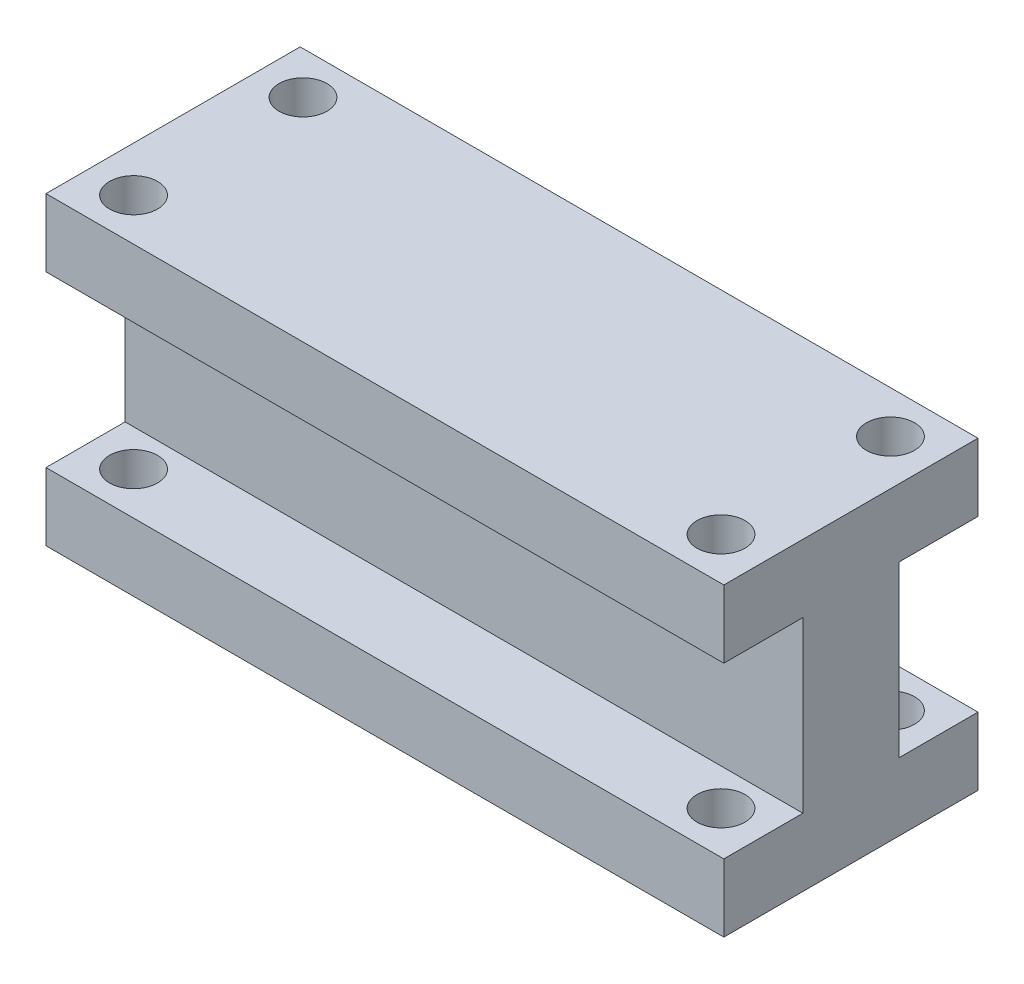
ISO-10303-21;
HEADER;
FILE_DESCRIPTION(('STEP AP214'),'2;1');
FILE_NAME('part.step','',(''),(''),'','','');
FILE_SCHEMA(('AUTOMOTIVE_DESIGN { 1 0 10303 214 1 1 1 1 }'));
ENDSEC;
DATA;
#1=APPLICATION_CONTEXT('core data for automotive mechanical design processes');
#2=APPLICATION_PROTOCOL_DEFINITION('international standard','automotive_design',2000,#1);
#3=PRODUCT_CONTEXT('',#1,'mechanical');
#4=PRODUCT('Part','Part','',(#3));
#5=PRODUCT_RELATED_PRODUCT_CATEGORY('part','',(#4));
#6=PRODUCT_DEFINITION_FORMATION('','',#4);
#7=PRODUCT_DEFINITION_CONTEXT('part definition',#1,'design');
#8=PRODUCT_DEFINITION('design','',#6,#7);
#9=PRODUCT_DEFINITION_SHAPE('','',#8);
#10=(LENGTH_UNIT() NAMED_UNIT(*) SI_UNIT(.MILLI.,.METRE.));
#11=(NAMED_UNIT(*) PLANE_ANGLE_UNIT() SI_UNIT($,.RADIAN.));
#12=(NAMED_UNIT(*) SI_UNIT($,.STERADIAN.) SOLID_ANGLE_UNIT());
#13=UNCERTAINTY_MEASURE_WITH_UNIT(LENGTH_MEASURE(1.E-05),#10,'distance_accuracy_value','');
#14=(GEOMETRIC_REPRESENTATION_CONTEXT(3) GLOBAL_UNCERTAINTY_ASSIGNED_CONTEXT((#13)) GLOBAL_UNIT_ASSIGNED_CONTEXT((#10,
#11,#12)) REPRESENTATION_CONTEXT('',''));
#15=CARTESIAN_POINT('',(0.,0.,0.));
#16=DIRECTION('',(0.,0.,1.));
#17=DIRECTION('',(1.,0.,0.));
#18=AXIS2_PLACEMENT_3D('',#15,#16,#17);
#19=CARTESIAN_POINT('',(52.,0.,15.));
#20=DIRECTION('',(0.,1.,0.));
#21=DIRECTION('',(0.,0.,1.));
#22=AXIS2_PLACEMENT_3D('',#19,#20,#21);
#23=CYLINDRICAL_SURFACE('',#22,4.25);
#24=CARTESIAN_POINT('',(52.,0.,15.));
#25=DIRECTION('',(0.,1.,0.));
#26=DIRECTION('',(0.,0.,1.));
#27=AXIS2_PLACEMENT_3D('',#24,#25,#26);
#28=CIRCLE('',#27,4.25);
#29=CARTESIAN_POINT('',(52.,0.,19.25));
#30=VERTEX_POINT('',#29);
#31=EDGE_CURVE('E153',#30,#30,#28,.F.);
#32=ORIENTED_EDGE('',*,*,#31,.T.);
#33=EDGE_LOOP('',(#32));
#34=FACE_BOUND('',#33,.T.);
#35=CARTESIAN_POINT('',(52.,12.,15.));
#36=DIRECTION('',(0.,1.,0.));
#37=DIRECTION('',(0.,0.,1.));
#38=AXIS2_PLACEMENT_3D('',#35,#36,#37);
#39=CIRCLE('',#38,4.25);
#40=CARTESIAN_POINT('',(52.,12.,19.25));
#41=VERTEX_POINT('',#40);
#42=EDGE_CURVE('E20',#41,#41,#39,.T.);
#43=ORIENTED_EDGE('',*,*,#42,.T.);
#44=EDGE_LOOP('',(#43));
#45=FACE_BOUND('',#44,.T.);
#46=ADVANCED_FACE('F17',(#34,#45),#23,.F.);
#47=CARTESIAN_POINT('',(-52.,0.,15.));
#48=DIRECTION('',(0.,1.,0.));
#49=DIRECTION('',(0.,0.,1.));
#50=AXIS2_PLACEMENT_3D('',#47,#48,#49);
#51=CYLINDRICAL_SURFACE('',#50,4.25);
#52=CARTESIAN_POINT('',(-52.,0.,15.));
#53=DIRECTION('',(0.,1.,0.));
#54=DIRECTION('',(0.,0.,1.));
#55=AXIS2_PLACEMENT_3D('',#52,#53,#54);
#56=CIRCLE('',#55,4.25);
#57=CARTESIAN_POINT('',(-52.,0.,19.25));
#58=VERTEX_POINT('',#57);
#59=EDGE_CURVE('E186',#58,#58,#56,.F.);
#60=ORIENTED_EDGE('',*,*,#59,.T.);
#61=EDGE_LOOP('',(#60));
#62=FACE_BOUND('',#61,.T.);
#63=CARTESIAN_POINT('',(-52.,12.,15.));
#64=DIRECTION('',(0.,1.,0.));
#65=DIRECTION('',(0.,0.,1.));
#66=AXIS2_PLACEMENT_3D('',#63,#64,#65);
#67=CIRCLE('',#66,4.25);
#68=CARTESIAN_POINT('',(-52.,12.,19.25));
#69=VERTEX_POINT('',#68);
#70=EDGE_CURVE('E156',#69,#69,#67,.T.);
#71=ORIENTED_EDGE('',*,*,#70,.T.);
#72=EDGE_LOOP('',(#71));
#73=FACE_BOUND('',#72,.T.);
#74=ADVANCED_FACE('F289',(#62,#73),#51,.F.);
#75=CARTESIAN_POINT('',(52.,0.,-15.));
#76=DIRECTION('',(0.,1.,0.));
#77=DIRECTION('',(0.,0.,1.));
#78=AXIS2_PLACEMENT_3D('',#75,#76,#77);
#79=CYLINDRICAL_SURFACE('',#78,4.25);
#80=CARTESIAN_POINT('',(52.,12.,-15.));
#81=DIRECTION('',(0.,1.,0.));
#82=DIRECTION('',(0.,0.,1.));
#83=AXIS2_PLACEMENT_3D('',#80,#81,#82);
#84=CIRCLE('',#83,4.25);
#85=CARTESIAN_POINT('',(52.,12.,-10.75));
#86=VERTEX_POINT('',#85);
#87=EDGE_CURVE('E147',#86,#86,#84,.T.);
#88=ORIENTED_EDGE('',*,*,#87,.T.);
#89=EDGE_LOOP('',(#88));
#90=FACE_BOUND('',#89,.T.);
#91=CARTESIAN_POINT('',(52.,0.,-15.));
#92=DIRECTION('',(0.,1.,0.));
#93=DIRECTION('',(0.,0.,1.));
#94=AXIS2_PLACEMENT_3D('',#91,#92,#93);
#95=CIRCLE('',#94,4.25);
#96=CARTESIAN_POINT('',(52.,0.,-10.75));
#97=VERTEX_POINT('',#96);
#98=EDGE_CURVE('E189',#97,#97,#95,.F.);
#99=ORIENTED_EDGE('',*,*,#98,.T.);
#100=EDGE_LOOP('',(#99));
#101=FACE_BOUND('',#100,.T.);
#102=ADVANCED_FACE('F293',(#90,#101),#79,.F.);
#103=CARTESIAN_POINT('',(-52.,0.,-15.));
#104=DIRECTION('',(0.,1.,0.));
#105=DIRECTION('',(0.,0.,1.));
#106=AXIS2_PLACEMENT_3D('',#103,#104,#105);
#107=CYLINDRICAL_SURFACE('',#106,4.25);
#108=CARTESIAN_POINT('',(-52.,12.,-15.));
#109=DIRECTION('',(0.,1.,0.));
#110=DIRECTION('',(0.,0.,1.));
#111=AXIS2_PLACEMENT_3D('',#108,#109,#110);
#112=CIRCLE('',#111,4.25);
#113=CARTESIAN_POINT('',(-52.,12.,-10.75));
#114=VERTEX_POINT('',#113);
#115=EDGE_CURVE('E119',#114,#114,#112,.T.);
#116=ORIENTED_EDGE('',*,*,#115,.T.);
#117=EDGE_LOOP('',(#116));
#118=FACE_BOUND('',#117,.T.);
#119=CARTESIAN_POINT('',(-52.,0.,-15.));
#120=DIRECTION('',(0.,1.,0.));
#121=DIRECTION('',(0.,0.,1.));
#122=AXIS2_PLACEMENT_3D('',#119,#120,#121);
#123=CIRCLE('',#122,4.25);
#124=CARTESIAN_POINT('',(-52.,0.,-10.75));
#125=VERTEX_POINT('',#124);
#126=EDGE_CURVE('E150',#125,#125,#123,.F.);
#127=ORIENTED_EDGE('',*,*,#126,.T.);
#128=EDGE_LOOP('',(#127));
#129=FACE_BOUND('',#128,.T.);
#130=ADVANCED_FACE('F214',(#118,#129),#107,.F.);
#131=CARTESIAN_POINT('',(-60.,12.,8.50000000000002));
#132=DIRECTION('',(0.,0.,-1.));
#133=DIRECTION('',(-1.,0.,0.));
#134=AXIS2_PLACEMENT_3D('',#131,#132,#133);
#135=PLANE('',#134);
#136=DIRECTION('',(1.,0.,0.));
#137=VECTOR('',#136,1.);
#138=CARTESIAN_POINT('',(-60.,42.,8.5));
#139=LINE('',#138,#137);
#140=CARTESIAN_POINT('',(60.,42.,8.5));
#141=VERTEX_POINT('',#140);
#142=CARTESIAN_POINT('',(-60.,42.,8.50000000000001));
#143=VERTEX_POINT('',#142);
#144=EDGE_CURVE('E139',#141,#143,#139,.F.);
#145=ORIENTED_EDGE('',*,*,#144,.T.);
#146=DIRECTION('',(0.,1.,0.));
#147=VECTOR('',#146,1.);
#148=CARTESIAN_POINT('',(-60.,54.,8.50000000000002));
#149=LINE('',#148,#147);
#150=CARTESIAN_POINT('',(-60.,12.,8.50000000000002));
#151=VERTEX_POINT('',#150);
#152=EDGE_CURVE('E451',#143,#151,#149,.F.);
#153=ORIENTED_EDGE('',*,*,#152,.T.);
#154=DIRECTION('',(1.,0.,0.));
#155=VECTOR('',#154,1.);
#156=CARTESIAN_POINT('',(-60.,12.,8.50000000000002));
#157=LINE('',#156,#155);
#158=CARTESIAN_POINT('',(60.,12.,8.50000000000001));
#159=VERTEX_POINT('',#158);
#160=EDGE_CURVE('E154',#151,#159,#157,.T.);
#161=ORIENTED_EDGE('',*,*,#160,.T.);
#162=DIRECTION('',(0.,1.,0.));
#163=VECTOR('',#162,1.);
#164=CARTESIAN_POINT('',(60.0000000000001,54.,8.5));
#165=LINE('',#164,#163);
#166=EDGE_CURVE('E467',#159,#141,#165,.T.);
#167=ORIENTED_EDGE('',*,*,#166,.T.);
#168=EDGE_LOOP('',(#145,#153,#161,#167));
#169=FACE_BOUND('',#168,.T.);
#170=ADVANCED_FACE('F203',(#169),#135,.F.);
#171=CARTESIAN_POINT('',(-60.,12.,36.5));
#172=DIRECTION('',(0.,-1.,0.));
#173=DIRECTION('',(0.,0.,-1.));
#174=AXIS2_PLACEMENT_3D('',#171,#172,#173);
#175=PLANE('',#174);
#176=ORIENTED_EDGE('',*,*,#160,.F.);
#177=DIRECTION('',(0.,0.,-1.));
#178=VECTOR('',#177,1.);
#179=CARTESIAN_POINT('',(-60.,12.,-22.5));
#180=LINE('',#179,#178);
#181=CARTESIAN_POINT('',(-60.,12.,22.5));
#182=VERTEX_POINT('',#181);
#183=EDGE_CURVE('E446',#151,#182,#180,.F.);
#184=ORIENTED_EDGE('',*,*,#183,.T.);
#185=DIRECTION('',(-1.,0.,0.));
#186=VECTOR('',#185,1.);
#187=CARTESIAN_POINT('',(-60.,12.,22.5));
#188=LINE('',#187,#186);
#189=CARTESIAN_POINT('',(60.0000000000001,12.,22.5));
#190=VERTEX_POINT('',#189);
#191=EDGE_CURVE('E151',#182,#190,#188,.F.);
#192=ORIENTED_EDGE('',*,*,#191,.T.);
#193=DIRECTION('',(0.,0.,1.));
#194=VECTOR('',#193,1.);
#195=CARTESIAN_POINT('',(60.,12.,-22.5));
#196=LINE('',#195,#194);
#197=EDGE_CURVE('E469',#190,#159,#196,.F.);
#198=ORIENTED_EDGE('',*,*,#197,.T.);
#199=EDGE_LOOP('',(#176,#184,#192,#198));
#200=FACE_BOUND('',#199,.T.);
#201=ORIENTED_EDGE('',*,*,#70,.F.);
#202=EDGE_LOOP('',(#201));
#203=FACE_BOUND('',#202,.T.);
#204=ORIENTED_EDGE('',*,*,#42,.F.);
#205=EDGE_LOOP('',(#204));
#206=FACE_BOUND('',#205,.T.);
#207=ADVANCED_FACE('F200',(#200,#203,#206),#175,.F.);
#208=CARTESIAN_POINT('',(-60.,54.,22.5));
#209=DIRECTION('',(0.,0.,-1.));
#210=DIRECTION('',(-1.,0.,0.));
#211=AXIS2_PLACEMENT_3D('',#208,#209,#210);
#212=PLANE('',#211);
#213=ORIENTED_EDGE('',*,*,#191,.F.);
#214=DIRECTION('',(0.,1.,0.));
#215=VECTOR('',#214,1.);
#216=CARTESIAN_POINT('',(-60.,54.,22.5));
#217=LINE('',#216,#215);
#218=CARTESIAN_POINT('',(-60.,0.,22.5));
#219=VERTEX_POINT('',#218);
#220=EDGE_CURVE('E442',#182,#219,#217,.F.);
#221=ORIENTED_EDGE('',*,*,#220,.T.);
#222=DIRECTION('',(1.,0.,0.));
#223=VECTOR('',#222,1.);
#224=CARTESIAN_POINT('',(0.,0.,22.5));
#225=LINE('',#224,#223);
#226=CARTESIAN_POINT('',(60.0000000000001,0.,22.5));
#227=VERTEX_POINT('',#226);
#228=EDGE_CURVE('E148',#219,#227,#225,.T.);
#229=ORIENTED_EDGE('',*,*,#228,.T.);
#230=DIRECTION('',(0.,1.,0.));
#231=VECTOR('',#230,1.);
#232=CARTESIAN_POINT('',(60.0000000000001,54.,22.5));
#233=LINE('',#232,#231);
#234=EDGE_CURVE('E135',#227,#190,#233,.T.);
#235=ORIENTED_EDGE('',*,*,#234,.T.);
#236=EDGE_LOOP('',(#213,#221,#229,#235));
#237=FACE_BOUND('',#236,.T.);
#238=ADVANCED_FACE('F202',(#237),#212,.F.);
#239=CARTESIAN_POINT('',(0.,0.,0.));
#240=DIRECTION('',(0.,1.,0.));
#241=DIRECTION('',(0.,0.,1.));
#242=AXIS2_PLACEMENT_3D('',#239,#240,#241);
#243=PLANE('',#242);
#244=ORIENTED_EDGE('',*,*,#228,.F.);
#245=DIRECTION('',(0.,0.,-1.));
#246=VECTOR('',#245,1.);
#247=CARTESIAN_POINT('',(-60.,0.,-22.5));
#248=LINE('',#247,#246);
#249=CARTESIAN_POINT('',(-60.,0.,-22.5));
#250=VERTEX_POINT('',#249);
#251=EDGE_CURVE('E437',#219,#250,#248,.T.);
#252=ORIENTED_EDGE('',*,*,#251,.T.);
#253=DIRECTION('',(1.,0.,0.));
#254=VECTOR('',#253,1.);
#255=CARTESIAN_POINT('',(-60.,0.,-22.5));
#256=LINE('',#255,#254);
#257=CARTESIAN_POINT('',(60.,0.,-22.5));
#258=VERTEX_POINT('',#257);
#259=EDGE_CURVE('E145',#250,#258,#256,.T.);
#260=ORIENTED_EDGE('',*,*,#259,.T.);
#261=DIRECTION('',(0.,0.,1.));
#262=VECTOR('',#261,1.);
#263=CARTESIAN_POINT('',(60.,0.,-22.5));
#264=LINE('',#263,#262);
#265=EDGE_CURVE('E133',#258,#227,#264,.T.);
#266=ORIENTED_EDGE('',*,*,#265,.T.);
#267=EDGE_LOOP('',(#244,#252,#260,#266));
#268=FACE_BOUND('',#267,.T.);
#269=ORIENTED_EDGE('',*,*,#126,.F.);
#270=EDGE_LOOP('',(#269));
#271=FACE_BOUND('',#270,.T.);
#272=ORIENTED_EDGE('',*,*,#59,.F.);
#273=EDGE_LOOP('',(#272));
#274=FACE_BOUND('',#273,.T.);
#275=ORIENTED_EDGE('',*,*,#98,.F.);
#276=EDGE_LOOP('',(#275));
#277=FACE_BOUND('',#276,.T.);
#278=ORIENTED_EDGE('',*,*,#31,.F.);
#279=EDGE_LOOP('',(#278));
#280=FACE_BOUND('',#279,.T.);
#281=ADVANCED_FACE('F211',(#268,#271,#274,#277,#280),#243,.F.);
#282=CARTESIAN_POINT('',(-60.,54.,-22.5));
#283=DIRECTION('',(0.,0.,1.));
#284=DIRECTION('',(1.,0.,0.));
#285=AXIS2_PLACEMENT_3D('',#282,#283,#284);
#286=PLANE('',#285);
#287=DIRECTION('',(1.,0.,0.));
#288=VECTOR('',#287,1.);
#289=CARTESIAN_POINT('',(-60.,12.,-22.5));
#290=LINE('',#289,#288);
#291=CARTESIAN_POINT('',(-60.,12.,-22.5));
#292=VERTEX_POINT('',#291);
#293=CARTESIAN_POINT('',(60.,12.,-22.5));
#294=VERTEX_POINT('',#293);
#295=EDGE_CURVE('E110',#292,#294,#290,.T.);
#296=ORIENTED_EDGE('',*,*,#295,.T.);
#297=DIRECTION('',(0.,1.,0.));
#298=VECTOR('',#297,1.);
#299=CARTESIAN_POINT('',(60.,54.,-22.5));
#300=LINE('',#299,#298);
#301=EDGE_CURVE('E114',#294,#258,#300,.F.);
#302=ORIENTED_EDGE('',*,*,#301,.T.);
#303=ORIENTED_EDGE('',*,*,#259,.F.);
#304=DIRECTION('',(0.,1.,0.));
#305=VECTOR('',#304,1.);
#306=CARTESIAN_POINT('',(-60.,54.,-22.5));
#307=LINE('',#306,#305);
#308=EDGE_CURVE('E117',#250,#292,#307,.T.);
#309=ORIENTED_EDGE('',*,*,#308,.T.);
#310=EDGE_LOOP('',(#296,#302,#303,#309));
#311=FACE_BOUND('',#310,.T.);
#312=ADVANCED_FACE('F111',(#311),#286,.F.);
#313=CARTESIAN_POINT('',(-60.,12.,-36.5));
#314=DIRECTION('',(0.,-1.,0.));
#315=DIRECTION('',(0.,0.,-1.));
#316=AXIS2_PLACEMENT_3D('',#313,#314,#315);
#317=PLANE('',#316);
#318=DIRECTION('',(1.,0.,0.));
#319=VECTOR('',#318,1.);
#320=CARTESIAN_POINT('',(-60.,12.,-8.49999999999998));
#321=LINE('',#320,#319);
#322=CARTESIAN_POINT('',(-60.,12.,-8.49999999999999));
#323=VERTEX_POINT('',#322);
#324=CARTESIAN_POINT('',(60.,12.,-8.5));
#325=VERTEX_POINT('',#324);
#326=EDGE_CURVE('E104',#323,#325,#321,.T.);
#327=ORIENTED_EDGE('',*,*,#326,.T.);
#328=DIRECTION('',(0.,0.,1.));
#329=VECTOR('',#328,1.);
#330=CARTESIAN_POINT('',(60.,12.,-22.5));
#331=LINE('',#330,#329);
#332=EDGE_CURVE('E122',#325,#294,#331,.F.);
#333=ORIENTED_EDGE('',*,*,#332,.T.);
#334=ORIENTED_EDGE('',*,*,#295,.F.);
#335=DIRECTION('',(0.,0.,-1.));
#336=VECTOR('',#335,1.);
#337=CARTESIAN_POINT('',(-60.,12.,-22.5));
#338=LINE('',#337,#336);
#339=EDGE_CURVE('E444',#292,#323,#338,.F.);
#340=ORIENTED_EDGE('',*,*,#339,.T.);
#341=EDGE_LOOP('',(#327,#333,#334,#340));
#342=FACE_BOUND('',#341,.T.);
#343=ORIENTED_EDGE('',*,*,#115,.F.);
#344=EDGE_LOOP('',(#343));
#345=FACE_BOUND('',#344,.T.);
#346=ORIENTED_EDGE('',*,*,#87,.F.);
#347=EDGE_LOOP('',(#346));
#348=FACE_BOUND('',#347,.T.);
#349=ADVANCED_FACE('F123',(#342,#345,#348),#317,.F.);
#350=CARTESIAN_POINT('',(-60.,12.,-8.49999999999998));
#351=DIRECTION('',(0.,0.,1.));
#352=DIRECTION('',(1.,0.,0.));
#353=AXIS2_PLACEMENT_3D('',#350,#351,#352);
#354=PLANE('',#353);
#355=ORIENTED_EDGE('',*,*,#326,.F.);
#356=DIRECTION('',(0.,1.,0.));
#357=VECTOR('',#356,1.);
#358=CARTESIAN_POINT('',(-60.,54.,-8.49999999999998));
#359=LINE('',#358,#357);
#360=CARTESIAN_POINT('',(-60.,42.,-8.49999999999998));
#361=VERTEX_POINT('',#360);
#362=EDGE_CURVE('E492',#323,#361,#359,.T.);
#363=ORIENTED_EDGE('',*,*,#362,.T.);
#364=DIRECTION('',(1.,0.,0.));
#365=VECTOR('',#364,1.);
#366=CARTESIAN_POINT('',(-60.,42.,-8.49999999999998));
#367=LINE('',#366,#365);
#368=CARTESIAN_POINT('',(60.,42.,-8.49999999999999));
#369=VERTEX_POINT('',#368);
#370=EDGE_CURVE('E142',#361,#369,#367,.T.);
#371=ORIENTED_EDGE('',*,*,#370,.T.);
#372=DIRECTION('',(0.,1.,0.));
#373=VECTOR('',#372,1.);
#374=CARTESIAN_POINT('',(60.,54.,-8.5));
#375=LINE('',#374,#373);
#376=EDGE_CURVE('E460',#369,#325,#375,.F.);
#377=ORIENTED_EDGE('',*,*,#376,.T.);
#378=EDGE_LOOP('',(#355,#363,#371,#377));
#379=FACE_BOUND('',#378,.T.);
#380=ADVANCED_FACE('F264',(#379),#354,.F.);
#381=CARTESIAN_POINT('',(-60.,42.,-36.5));
#382=DIRECTION('',(0.,1.,0.));
#383=DIRECTION('',(0.,0.,1.));
#384=AXIS2_PLACEMENT_3D('',#381,#382,#383);
#385=PLANE('',#384);
#386=ORIENTED_EDGE('',*,*,#370,.F.);
#387=DIRECTION('',(0.,0.,-1.));
#388=VECTOR('',#387,1.);
#389=CARTESIAN_POINT('',(-60.,42.,-22.5));
#390=LINE('',#389,#388);
#391=CARTESIAN_POINT('',(-60.,42.,-22.5));
#392=VERTEX_POINT('',#391);
#393=EDGE_CURVE('E490',#361,#392,#390,.T.);
#394=ORIENTED_EDGE('',*,*,#393,.T.);
#395=DIRECTION('',(1.,0.,0.));
#396=VECTOR('',#395,1.);
#397=CARTESIAN_POINT('',(-60.,42.,-22.5));
#398=LINE('',#397,#396);
#399=CARTESIAN_POINT('',(60.,42.,-22.5));
#400=VERTEX_POINT('',#399);
#401=EDGE_CURVE('E458',#392,#400,#398,.T.);
#402=ORIENTED_EDGE('',*,*,#401,.T.);
#403=DIRECTION('',(0.,0.,1.));
#404=VECTOR('',#403,1.);
#405=CARTESIAN_POINT('',(60.,42.,-22.5));
#406=LINE('',#405,#404);
#407=EDGE_CURVE('E462',#400,#369,#406,.T.);
#408=ORIENTED_EDGE('',*,*,#407,.T.);
#409=EDGE_LOOP('',(#386,#394,#402,#408));
#410=FACE_BOUND('',#409,.T.);
#411=CARTESIAN_POINT('',(-52.,42.,-15.));
#412=DIRECTION('',(0.,1.,0.));
#413=DIRECTION('',(0.,0.,1.));
#414=AXIS2_PLACEMENT_3D('',#411,#412,#413);
#415=CIRCLE('',#414,4.25);
#416=CARTESIAN_POINT('',(-52.,42.,-10.75));
#417=VERTEX_POINT('',#416);
#418=EDGE_CURVE('E127',#417,#417,#415,.T.);
#419=ORIENTED_EDGE('',*,*,#418,.T.);
#420=EDGE_LOOP('',(#419));
#421=FACE_BOUND('',#420,.T.);
#422=CARTESIAN_POINT('',(52.,42.,-15.));
#423=DIRECTION('',(0.,1.,0.));
#424=DIRECTION('',(0.,0.,1.));
#425=AXIS2_PLACEMENT_3D('',#422,#423,#424);
#426=CIRCLE('',#425,4.25);
#427=CARTESIAN_POINT('',(52.,42.,-10.75));
#428=VERTEX_POINT('',#427);
#429=EDGE_CURVE('E175',#428,#428,#426,.T.);
#430=ORIENTED_EDGE('',*,*,#429,.T.);
#431=EDGE_LOOP('',(#430));
#432=FACE_BOUND('',#431,.T.);
#433=ADVANCED_FACE('F260',(#410,#421,#432),#385,.F.);
#434=CARTESIAN_POINT('',(-60.,42.,36.5));
#435=DIRECTION('',(0.,1.,0.));
#436=DIRECTION('',(0.,0.,1.));
#437=AXIS2_PLACEMENT_3D('',#434,#435,#436);
#438=PLANE('',#437);
#439=ORIENTED_EDGE('',*,*,#144,.F.);
#440=DIRECTION('',(0.,0.,1.));
#441=VECTOR('',#440,1.);
#442=CARTESIAN_POINT('',(60.,42.,-22.5));
#443=LINE('',#442,#441);
#444=CARTESIAN_POINT('',(60.0000000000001,42.,22.5));
#445=VERTEX_POINT('',#444);
#446=EDGE_CURVE('E465',#141,#445,#443,.T.);
#447=ORIENTED_EDGE('',*,*,#446,.T.);
#448=DIRECTION('',(-1.,0.,0.));
#449=VECTOR('',#448,1.);
#450=CARTESIAN_POINT('',(-60.,42.,22.5));
#451=LINE('',#450,#449);
#452=CARTESIAN_POINT('',(-60.,42.,22.5));
#453=VERTEX_POINT('',#452);
#454=EDGE_CURVE('E479',#445,#453,#451,.T.);
#455=ORIENTED_EDGE('',*,*,#454,.T.);
#456=DIRECTION('',(0.,0.,-1.));
#457=VECTOR('',#456,1.);
#458=CARTESIAN_POINT('',(-60.,42.,-22.5));
#459=LINE('',#458,#457);
#460=EDGE_CURVE('E453',#453,#143,#459,.T.);
#461=ORIENTED_EDGE('',*,*,#460,.T.);
#462=EDGE_LOOP('',(#439,#447,#455,#461));
#463=FACE_BOUND('',#462,.T.);
#464=CARTESIAN_POINT('',(-52.,42.,15.));
#465=DIRECTION('',(0.,1.,0.));
#466=DIRECTION('',(0.,0.,1.));
#467=AXIS2_PLACEMENT_3D('',#464,#465,#466);
#468=CIRCLE('',#467,4.25);
#469=CARTESIAN_POINT('',(-52.,42.,19.25));
#470=VERTEX_POINT('',#469);
#471=EDGE_CURVE('E172',#470,#470,#468,.T.);
#472=ORIENTED_EDGE('',*,*,#471,.T.);
#473=EDGE_LOOP('',(#472));
#474=FACE_BOUND('',#473,.T.);
#475=CARTESIAN_POINT('',(52.,42.,15.));
#476=DIRECTION('',(0.,1.,0.));
#477=DIRECTION('',(0.,0.,1.));
#478=AXIS2_PLACEMENT_3D('',#475,#476,#477);
#479=CIRCLE('',#478,4.25);
#480=CARTESIAN_POINT('',(52.,42.,19.25));
#481=VERTEX_POINT('',#480);
#482=EDGE_CURVE('E141',#481,#481,#479,.T.);
#483=ORIENTED_EDGE('',*,*,#482,.T.);
#484=EDGE_LOOP('',(#483));
#485=FACE_BOUND('',#484,.T.);
#486=ADVANCED_FACE('F256',(#463,#474,#485),#438,.F.);
#487=CARTESIAN_POINT('',(52.,0.,15.));
#488=DIRECTION('',(0.,1.,0.));
#489=DIRECTION('',(0.,0.,1.));
#490=AXIS2_PLACEMENT_3D('',#487,#488,#489);
#491=CYLINDRICAL_SURFACE('',#490,4.25);
#492=CARTESIAN_POINT('',(52.,54.,15.));
#493=DIRECTION('',(0.,1.,0.));
#494=DIRECTION('',(0.,0.,1.));
#495=AXIS2_PLACEMENT_3D('',#492,#493,#494);
#496=CIRCLE('',#495,4.25);
#497=CARTESIAN_POINT('',(52.,54.,19.25));
#498=VERTEX_POINT('',#497);
#499=EDGE_CURVE('E167',#498,#498,#496,.F.);
#500=ORIENTED_EDGE('',*,*,#499,.F.);
#501=EDGE_LOOP('',(#500));
#502=FACE_BOUND('',#501,.T.);
#503=ORIENTED_EDGE('',*,*,#482,.F.);
#504=EDGE_LOOP('',(#503));
#505=FACE_BOUND('',#504,.T.);
#506=ADVANCED_FACE('F252',(#502,#505),#491,.F.);
#507=CARTESIAN_POINT('',(52.,0.,-15.));
#508=DIRECTION('',(0.,1.,0.));
#509=DIRECTION('',(0.,0.,1.));
#510=AXIS2_PLACEMENT_3D('',#507,#508,#509);
#511=CYLINDRICAL_SURFACE('',#510,4.25);
#512=CARTESIAN_POINT('',(52.,54.,-15.));
#513=DIRECTION('',(0.,1.,0.));
#514=DIRECTION('',(0.,0.,1.));
#515=AXIS2_PLACEMENT_3D('',#512,#513,#514);
#516=CIRCLE('',#515,4.25);
#517=CARTESIAN_POINT('',(52.,54.,-10.75));
#518=VERTEX_POINT('',#517);
#519=EDGE_CURVE('E164',#518,#518,#516,.F.);
#520=ORIENTED_EDGE('',*,*,#519,.F.);
#521=EDGE_LOOP('',(#520));
#522=FACE_BOUND('',#521,.T.);
#523=ORIENTED_EDGE('',*,*,#429,.F.);
#524=EDGE_LOOP('',(#523));
#525=FACE_BOUND('',#524,.T.);
#526=ADVANCED_FACE('F248',(#522,#525),#511,.F.);
#527=CARTESIAN_POINT('',(-52.,0.,15.));
#528=DIRECTION('',(0.,1.,0.));
#529=DIRECTION('',(0.,0.,1.));
#530=AXIS2_PLACEMENT_3D('',#527,#528,#529);
#531=CYLINDRICAL_SURFACE('',#530,4.25);
#532=CARTESIAN_POINT('',(-52.,54.,15.));
#533=DIRECTION('',(0.,1.,0.));
#534=DIRECTION('',(0.,0.,1.));
#535=AXIS2_PLACEMENT_3D('',#532,#533,#534);
#536=CIRCLE('',#535,4.25);
#537=CARTESIAN_POINT('',(-52.,54.,19.25));
#538=VERTEX_POINT('',#537);
#539=EDGE_CURVE('E161',#538,#538,#536,.F.);
#540=ORIENTED_EDGE('',*,*,#539,.F.);
#541=EDGE_LOOP('',(#540));
#542=FACE_BOUND('',#541,.T.);
#543=ORIENTED_EDGE('',*,*,#471,.F.);
#544=EDGE_LOOP('',(#543));
#545=FACE_BOUND('',#544,.T.);
#546=ADVANCED_FACE('F244',(#542,#545),#531,.F.);
#547=CARTESIAN_POINT('',(-52.,0.,-15.));
#548=DIRECTION('',(0.,1.,0.));
#549=DIRECTION('',(0.,0.,1.));
#550=AXIS2_PLACEMENT_3D('',#547,#548,#549);
#551=CYLINDRICAL_SURFACE('',#550,4.25);
#552=CARTESIAN_POINT('',(-52.,54.,-15.));
#553=DIRECTION('',(0.,1.,0.));
#554=DIRECTION('',(0.,0.,1.));
#555=AXIS2_PLACEMENT_3D('',#552,#553,#554);
#556=CIRCLE('',#555,4.25);
#557=CARTESIAN_POINT('',(-52.,54.,-10.75));
#558=VERTEX_POINT('',#557);
#559=EDGE_CURVE('E157',#558,#558,#556,.F.);
#560=ORIENTED_EDGE('',*,*,#559,.F.);
#561=EDGE_LOOP('',(#560));
#562=FACE_BOUND('',#561,.T.);
#563=ORIENTED_EDGE('',*,*,#418,.F.);
#564=EDGE_LOOP('',(#563));
#565=FACE_BOUND('',#564,.T.);
#566=ADVANCED_FACE('F241',(#562,#565),#551,.F.);
#567=CARTESIAN_POINT('',(60.,54.,-22.5));
#568=DIRECTION('',(-1.,0.,0.));
#569=DIRECTION('',(0.,0.,1.));
#570=AXIS2_PLACEMENT_3D('',#567,#568,#569);
#571=PLANE('',#570);
#572=ORIENTED_EDGE('',*,*,#407,.F.);
#573=DIRECTION('',(0.,1.,0.));
#574=VECTOR('',#573,1.);
#575=CARTESIAN_POINT('',(60.,54.,-22.5));
#576=LINE('',#575,#574);
#577=CARTESIAN_POINT('',(60.,54.,-22.5));
#578=VERTEX_POINT('',#577);
#579=EDGE_CURVE('E456',#400,#578,#576,.T.);
#580=ORIENTED_EDGE('',*,*,#579,.T.);
#581=DIRECTION('',(0.,0.,1.));
#582=VECTOR('',#581,1.);
#583=CARTESIAN_POINT('',(60.0000000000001,54.,0.));
#584=LINE('',#583,#582);
#585=CARTESIAN_POINT('',(60.0000000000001,54.,22.5));
#586=VERTEX_POINT('',#585);
#587=EDGE_CURVE('E160',#586,#578,#584,.F.);
#588=ORIENTED_EDGE('',*,*,#587,.F.);
#589=DIRECTION('',(0.,1.,0.));
#590=VECTOR('',#589,1.);
#591=CARTESIAN_POINT('',(60.,54.,22.5));
#592=LINE('',#591,#590);
#593=EDGE_CURVE('E482',#586,#445,#592,.F.);
#594=ORIENTED_EDGE('',*,*,#593,.T.);
#595=ORIENTED_EDGE('',*,*,#446,.F.);
#596=ORIENTED_EDGE('',*,*,#166,.F.);
#597=ORIENTED_EDGE('',*,*,#197,.F.);
#598=ORIENTED_EDGE('',*,*,#234,.F.);
#599=ORIENTED_EDGE('',*,*,#265,.F.);
#600=ORIENTED_EDGE('',*,*,#301,.F.);
#601=ORIENTED_EDGE('',*,*,#332,.F.);
#602=ORIENTED_EDGE('',*,*,#376,.F.);
#603=EDGE_LOOP('',(#572,#580,#588,#594,#595,#596,#597,#598,#599,#600,#601,#602));
#604=FACE_BOUND('',#603,.T.);
#605=ADVANCED_FACE('F130',(#604),#571,.F.);
#606=CARTESIAN_POINT('',(-60.,54.,-22.5));
#607=DIRECTION('',(0.,0.,1.));
#608=DIRECTION('',(1.,0.,0.));
#609=AXIS2_PLACEMENT_3D('',#606,#607,#608);
#610=PLANE('',#609);
#611=ORIENTED_EDGE('',*,*,#401,.F.);
#612=DIRECTION('',(0.,1.,0.));
#613=VECTOR('',#612,1.);
#614=CARTESIAN_POINT('',(-60.,54.,-22.5));
#615=LINE('',#614,#613);
#616=CARTESIAN_POINT('',(-60.,54.,-22.5));
#617=VERTEX_POINT('',#616);
#618=EDGE_CURVE('E485',#392,#617,#615,.T.);
#619=ORIENTED_EDGE('',*,*,#618,.T.);
#620=DIRECTION('',(1.,0.,0.));
#621=VECTOR('',#620,1.);
#622=CARTESIAN_POINT('',(0.,54.,-22.5));
#623=LINE('',#622,#621);
#624=EDGE_CURVE('E501',#578,#617,#623,.F.);
#625=ORIENTED_EDGE('',*,*,#624,.F.);
#626=ORIENTED_EDGE('',*,*,#579,.F.);
#627=EDGE_LOOP('',(#611,#619,#625,#626));
#628=FACE_BOUND('',#627,.T.);
#629=ADVANCED_FACE('F235',(#628),#610,.F.);
#630=CARTESIAN_POINT('',(-60.,54.,-22.5));
#631=DIRECTION('',(1.,0.,0.));
#632=DIRECTION('',(0.,0.,-1.));
#633=AXIS2_PLACEMENT_3D('',#630,#631,#632);
#634=PLANE('',#633);
#635=ORIENTED_EDGE('',*,*,#393,.F.);
#636=ORIENTED_EDGE('',*,*,#362,.F.);
#637=ORIENTED_EDGE('',*,*,#339,.F.);
#638=ORIENTED_EDGE('',*,*,#308,.F.);
#639=ORIENTED_EDGE('',*,*,#251,.F.);
#640=ORIENTED_EDGE('',*,*,#220,.F.);
#641=ORIENTED_EDGE('',*,*,#183,.F.);
#642=ORIENTED_EDGE('',*,*,#152,.F.);
#643=ORIENTED_EDGE('',*,*,#460,.F.);
#644=DIRECTION('',(0.,1.,0.));
#645=VECTOR('',#644,1.);
#646=CARTESIAN_POINT('',(-60.,54.,22.5));
#647=LINE('',#646,#645);
#648=CARTESIAN_POINT('',(-60.,54.,22.5));
#649=VERTEX_POINT('',#648);
#650=EDGE_CURVE('E35',#453,#649,#647,.T.);
#651=ORIENTED_EDGE('',*,*,#650,.T.);
#652=DIRECTION('',(0.,0.,1.));
#653=VECTOR('',#652,1.);
#654=CARTESIAN_POINT('',(-60.,54.,0.));
#655=LINE('',#654,#653);
#656=EDGE_CURVE('E26',#617,#649,#655,.T.);
#657=ORIENTED_EDGE('',*,*,#656,.F.);
#658=ORIENTED_EDGE('',*,*,#618,.F.);
#659=EDGE_LOOP('',(#635,#636,#637,#638,#639,#640,#641,#642,#643,#651,#657,#658));
#660=FACE_BOUND('',#659,.T.);
#661=ADVANCED_FACE('F227',(#660),#634,.F.);
#662=CARTESIAN_POINT('',(-60.,54.,22.5));
#663=DIRECTION('',(0.,0.,-1.));
#664=DIRECTION('',(-1.,0.,0.));
#665=AXIS2_PLACEMENT_3D('',#662,#663,#664);
#666=PLANE('',#665);
#667=ORIENTED_EDGE('',*,*,#454,.F.);
#668=ORIENTED_EDGE('',*,*,#593,.F.);
#669=DIRECTION('',(1.,0.,0.));
#670=VECTOR('',#669,1.);
#671=CARTESIAN_POINT('',(0.,54.,22.5));
#672=LINE('',#671,#670);
#673=EDGE_CURVE('E11',#649,#586,#672,.T.);
#674=ORIENTED_EDGE('',*,*,#673,.F.);
#675=ORIENTED_EDGE('',*,*,#650,.F.);
#676=EDGE_LOOP('',(#667,#668,#674,#675));
#677=FACE_BOUND('',#676,.T.);
#678=ADVANCED_FACE('F221',(#677),#666,.F.);
#679=CARTESIAN_POINT('',(0.,54.,0.));
#680=DIRECTION('',(0.,1.,0.));
#681=DIRECTION('',(0.,0.,1.));
#682=AXIS2_PLACEMENT_3D('',#679,#680,#681);
#683=PLANE('',#682);
#684=ORIENTED_EDGE('',*,*,#656,.T.);
#685=ORIENTED_EDGE('',*,*,#673,.T.);
#686=ORIENTED_EDGE('',*,*,#587,.T.);
#687=ORIENTED_EDGE('',*,*,#624,.T.);
#688=EDGE_LOOP('',(#684,#685,#686,#687));
#689=FACE_BOUND('',#688,.T.);
#690=ORIENTED_EDGE('',*,*,#559,.T.);
#691=EDGE_LOOP('',(#690));
#692=FACE_BOUND('',#691,.T.);
#693=ORIENTED_EDGE('',*,*,#539,.T.);
#694=EDGE_LOOP('',(#693));
#695=FACE_BOUND('',#694,.T.);
#696=ORIENTED_EDGE('',*,*,#519,.T.);
#697=EDGE_LOOP('',(#696));
#698=FACE_BOUND('',#697,.T.);
#699=ORIENTED_EDGE('',*,*,#499,.T.);
#700=EDGE_LOOP('',(#699));
#701=FACE_BOUND('',#700,.T.);
#702=ADVANCED_FACE('F219',(#689,#692,#695,#698,#701),#683,.T.);
#703=CLOSED_SHELL('',(#46,#74,#102,#130,#170,#207,#238,#281,#312,#349,#380,#433,#486,#506,#526,
#546,#566,#605,#629,#661,#678,#702));
#704=MANIFOLD_SOLID_BREP('B1',#703);
#705=ADVANCED_BREP_SHAPE_REPRESENTATION('',(#18,#704),#14);
#706=SHAPE_DEFINITION_REPRESENTATION(#9,#705);
ENDSEC;
END-ISO-10303-21;
